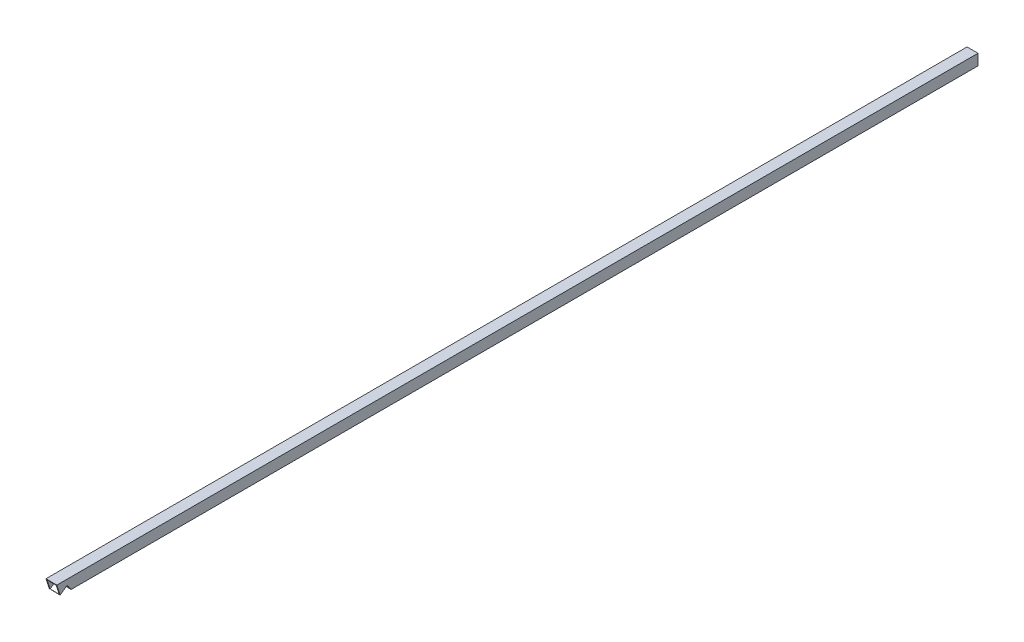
ISO-10303-21;
HEADER;
FILE_DESCRIPTION(('STEP AP214'),'2;1');
FILE_NAME('part.step','',(''),(''),'','','');
FILE_SCHEMA(('AUTOMOTIVE_DESIGN { 1 0 10303 214 1 1 1 1 }'));
ENDSEC;
DATA;
#1=APPLICATION_CONTEXT('core data for automotive mechanical design processes');
#2=APPLICATION_PROTOCOL_DEFINITION('international standard','automotive_design',2000,#1);
#3=PRODUCT_CONTEXT('',#1,'mechanical');
#4=PRODUCT('Part','Part','',(#3));
#5=PRODUCT_RELATED_PRODUCT_CATEGORY('part','',(#4));
#6=PRODUCT_DEFINITION_FORMATION('','',#4);
#7=PRODUCT_DEFINITION_CONTEXT('part definition',#1,'design');
#8=PRODUCT_DEFINITION('design','',#6,#7);
#9=PRODUCT_DEFINITION_SHAPE('','',#8);
#10=(LENGTH_UNIT() NAMED_UNIT(*) SI_UNIT(.MILLI.,.METRE.));
#11=(NAMED_UNIT(*) PLANE_ANGLE_UNIT() SI_UNIT($,.RADIAN.));
#12=(NAMED_UNIT(*) SI_UNIT($,.STERADIAN.) SOLID_ANGLE_UNIT());
#13=UNCERTAINTY_MEASURE_WITH_UNIT(LENGTH_MEASURE(1.E-05),#10,'distance_accuracy_value','');
#14=(GEOMETRIC_REPRESENTATION_CONTEXT(3) GLOBAL_UNCERTAINTY_ASSIGNED_CONTEXT((#13)) GLOBAL_UNIT_ASSIGNED_CONTEXT((#10,
#11,#12)) REPRESENTATION_CONTEXT('',''));
#15=CARTESIAN_POINT('',(0.,0.,0.));
#16=DIRECTION('',(0.,0.,1.));
#17=DIRECTION('',(1.,0.,0.));
#18=AXIS2_PLACEMENT_3D('',#15,#16,#17);
#19=CARTESIAN_POINT('',(-17.,-17.,-60.));
#20=DIRECTION('',(0.,1.,0.));
#21=DIRECTION('',(1.,0.,0.));
#22=AXIS2_PLACEMENT_3D('',#19,#20,#21);
#23=PLANE('',#22);
#24=DIRECTION('',(1.,0.,0.));
#25=VECTOR('',#24,1.);
#26=CARTESIAN_POINT('',(-8.5,-17.,3350.151413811));
#27=LINE('',#26,#25);
#28=CARTESIAN_POINT('',(-17.,-17.,3350.151413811));
#29=VERTEX_POINT('',#28);
#30=CARTESIAN_POINT('',(17.,-17.,3350.151413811));
#31=VERTEX_POINT('',#30);
#32=EDGE_CURVE('E44',#29,#31,#27,.T.);
#33=ORIENTED_EDGE('',*,*,#32,.F.);
#34=DIRECTION('',(0.,0.,1.));
#35=VECTOR('',#34,1.);
#36=CARTESIAN_POINT('',(-17.,-17.,-60.));
#37=LINE('',#36,#35);
#38=CARTESIAN_POINT('',(-17.,-17.,3350.660626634));
#39=VERTEX_POINT('',#38);
#40=EDGE_CURVE('E312',#29,#39,#37,.T.);
#41=ORIENTED_EDGE('',*,*,#40,.T.);
#42=DIRECTION('',(-0.99993959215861,0.,-0.0109914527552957));
#43=VECTOR('',#42,1.);
#44=CARTESIAN_POINT('',(-45.65715380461,-17.,3350.345623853));
#45=LINE('',#44,#43);
#46=CARTESIAN_POINT('',(17.,-17.,3351.034358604));
#47=VERTEX_POINT('',#46);
#48=EDGE_CURVE('E317',#47,#39,#45,.T.);
#49=ORIENTED_EDGE('',*,*,#48,.F.);
#50=DIRECTION('',(0.,0.,1.));
#51=VECTOR('',#50,1.);
#52=CARTESIAN_POINT('',(17.,-17.,-60.));
#53=LINE('',#52,#51);
#54=EDGE_CURVE('E290',#31,#47,#53,.T.);
#55=ORIENTED_EDGE('',*,*,#54,.F.);
#56=EDGE_LOOP('',(#33,#41,#49,#55));
#57=FACE_BOUND('',#56,.T.);
#58=ADVANCED_FACE('F16',(#57),#23,.T.);
#59=CARTESIAN_POINT('',(25.49490152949,-2.340582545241,3325.717145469));
#60=DIRECTION('',(-0.999800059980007,0.0114654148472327,-0.0163824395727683));
#61=DIRECTION('',(0.,-0.819285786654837,-0.573385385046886));
#62=AXIS2_PLACEMENT_3D('',#59,#60,#61);
#63=CYLINDRICAL_SURFACE('',#62,2.);
#64=DIRECTION('',(-0.999800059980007,0.0114654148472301,-0.0163824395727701));
#65=VECTOR('',#64,1.);
#66=CARTESIAN_POINT('',(25.534893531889,-1.194041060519,3324.078901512));
#67=LINE('',#66,#65);
#68=CARTESIAN_POINT('',(-17.,-0.706263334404,3323.381936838));
#69=VERTEX_POINT('',#68);
#70=CARTESIAN_POINT('',(-20.,-0.671860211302,3323.332779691));
#71=VERTEX_POINT('',#70);
#72=EDGE_CURVE('E168',#69,#71,#67,.T.);
#73=ORIENTED_EDGE('',*,*,#72,.F.);
#74=CARTESIAN_POINT('',(-17.,-1.853263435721,3325.020836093));
#75=DIRECTION('',(1.,0.,0.));
#76=DIRECTION('',(0.,0.573385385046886,-0.819285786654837));
#77=AXIS2_PLACEMENT_3D('',#74,#75,#76);
#78=ELLIPSE('',#77,2.000399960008,2.);
#79=CARTESIAN_POINT('',(-17.,-0.214691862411,3326.167606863));
#80=VERTEX_POINT('',#79);
#81=EDGE_CURVE('E204',#69,#80,#78,.T.);
#82=ORIENTED_EDGE('',*,*,#81,.T.);
#83=DIRECTION('',(-0.999800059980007,0.0114654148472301,-0.0163824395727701));
#84=VECTOR('',#83,1.);
#85=CARTESIAN_POINT('',(25.49490152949,-0.702010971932,3326.86391624));
#86=LINE('',#85,#84);
#87=CARTESIAN_POINT('',(-20.,-0.180288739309,3326.118449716));
#88=VERTEX_POINT('',#87);
#89=EDGE_CURVE('E10',#80,#88,#86,.T.);
#90=ORIENTED_EDGE('',*,*,#89,.T.);
#91=CARTESIAN_POINT('',(-20.,-1.818860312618,3324.971678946));
#92=DIRECTION('',(1.,0.,0.));
#93=DIRECTION('',(0.,0.573385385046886,-0.819285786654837));
#94=AXIS2_PLACEMENT_3D('',#91,#92,#93);
#95=ELLIPSE('',#94,2.000399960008,2.);
#96=EDGE_CURVE('E172',#71,#88,#95,.T.);
#97=ORIENTED_EDGE('',*,*,#96,.F.);
#98=EDGE_LOOP('',(#73,#82,#90,#97));
#99=FACE_BOUND('',#98,.T.);
#100=ADVANCED_FACE('F345',(#99),#63,.F.);
#101=CARTESIAN_POINT('',(25.49490152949,-2.340582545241,3325.717145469));
#102=DIRECTION('',(-0.999800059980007,0.0114654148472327,-0.0163824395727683));
#103=DIRECTION('',(0.,-0.819285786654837,-0.573385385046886));
#104=AXIS2_PLACEMENT_3D('',#101,#102,#103);
#105=CYLINDRICAL_SURFACE('',#104,2.);
#106=DIRECTION('',(-0.999800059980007,0.0114654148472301,-0.0163824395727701));
#107=VECTOR('',#106,1.);
#108=CARTESIAN_POINT('',(25.534893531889,-1.194041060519,3324.078901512));
#109=LINE('',#108,#107);
#110=CARTESIAN_POINT('',(20.,-1.130568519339,3323.98820832));
#111=VERTEX_POINT('',#110);
#112=CARTESIAN_POINT('',(17.,-1.096165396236,3323.939051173));
#113=VERTEX_POINT('',#112);
#114=EDGE_CURVE('E241',#111,#113,#109,.T.);
#115=ORIENTED_EDGE('',*,*,#114,.F.);
#116=CARTESIAN_POINT('',(20.,-2.277568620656,3325.627107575));
#117=DIRECTION('',(-1.,0.,0.));
#118=DIRECTION('',(0.,0.573385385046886,-0.819285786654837));
#119=AXIS2_PLACEMENT_3D('',#116,#117,#118);
#120=ELLIPSE('',#119,2.000399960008,2.);
#121=CARTESIAN_POINT('',(20.,-0.638997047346,3326.773878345));
#122=VERTEX_POINT('',#121);
#123=EDGE_CURVE('E240',#122,#111,#120,.T.);
#124=ORIENTED_EDGE('',*,*,#123,.F.);
#125=DIRECTION('',(-0.999800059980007,0.0114654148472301,-0.0163824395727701));
#126=VECTOR('',#125,1.);
#127=CARTESIAN_POINT('',(25.49490152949,-0.702010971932,3326.86391624));
#128=LINE('',#127,#126);
#129=CARTESIAN_POINT('',(17.,-0.604593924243,3326.724721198));
#130=VERTEX_POINT('',#129);
#131=EDGE_CURVE('E24',#122,#130,#128,.T.);
#132=ORIENTED_EDGE('',*,*,#131,.T.);
#133=CARTESIAN_POINT('',(17.,-2.243165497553,3325.577950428));
#134=DIRECTION('',(-1.,0.,0.));
#135=DIRECTION('',(0.,0.573385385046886,-0.819285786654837));
#136=AXIS2_PLACEMENT_3D('',#133,#134,#135);
#137=ELLIPSE('',#136,2.000399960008,2.);
#138=EDGE_CURVE('E283',#130,#113,#137,.T.);
#139=ORIENTED_EDGE('',*,*,#138,.T.);
#140=EDGE_LOOP('',(#115,#124,#132,#139));
#141=FACE_BOUND('',#140,.T.);
#142=ADVANCED_FACE('F334',(#141),#105,.F.);
#143=CARTESIAN_POINT('',(0.,-14.74714415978,3346.932404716));
#144=DIRECTION('',(0.,0.819285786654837,0.573385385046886));
#145=DIRECTION('',(1.,0.,0.));
#146=AXIS2_PLACEMENT_3D('',#143,#144,#145);
#147=PLANE('',#146);
#148=DIRECTION('',(0.,-0.573385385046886,0.819285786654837));
#149=VECTOR('',#148,1.);
#150=CARTESIAN_POINT('',(-17.,790.70297218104,2196.059275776));
#151=LINE('',#150,#149);
#152=EDGE_CURVE('E208',#80,#29,#151,.T.);
#153=ORIENTED_EDGE('',*,*,#152,.T.);
#154=ORIENTED_EDGE('',*,*,#32,.T.);
#155=DIRECTION('',(0.,0.573385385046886,-0.819285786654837));
#156=VECTOR('',#155,1.);
#157=CARTESIAN_POINT('',(17.,785.11386858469,2204.045306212));
#158=LINE('',#157,#156);
#159=EDGE_CURVE('E286',#31,#130,#158,.T.);
#160=ORIENTED_EDGE('',*,*,#159,.T.);
#161=ORIENTED_EDGE('',*,*,#131,.F.);
#162=DIRECTION('',(0.,0.573385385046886,-0.819285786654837));
#163=VECTOR('',#162,1.);
#164=CARTESIAN_POINT('',(20.,784.62071238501,2204.749955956));
#165=LINE('',#164,#163);
#166=CARTESIAN_POINT('',(20.,-17.52518622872,3350.90182989));
#167=VERTEX_POINT('',#166);
#168=EDGE_CURVE('E199',#167,#122,#165,.T.);
#169=ORIENTED_EDGE('',*,*,#168,.F.);
#170=DIRECTION('',(0.999939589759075,-0.00630246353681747,0.00900531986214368));
#171=VECTOR('',#170,1.);
#172=CARTESIAN_POINT('',(-15.16649180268,-17.30353730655,3350.585125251));
#173=LINE('',#172,#171);
#174=CARTESIAN_POINT('',(-20.,-17.27307245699,3350.541595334));
#175=VERTEX_POINT('',#174);
#176=EDGE_CURVE('E207',#175,#167,#173,.T.);
#177=ORIENTED_EDGE('',*,*,#176,.F.);
#178=DIRECTION('',(0.,-0.573385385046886,0.819285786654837));
#179=VECTOR('',#178,1.);
#180=CARTESIAN_POINT('',(-20.,791.19612838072,2195.354626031));
#181=LINE('',#180,#179);
#182=EDGE_CURVE('E249',#88,#175,#181,.T.);
#183=ORIENTED_EDGE('',*,*,#182,.F.);
#184=ORIENTED_EDGE('',*,*,#89,.F.);
#185=EDGE_LOOP('',(#153,#154,#160,#161,#169,#177,#183,#184));
#186=FACE_BOUND('',#185,.T.);
#187=ADVANCED_FACE('F323',(#186),#147,.F.);
#188=CARTESIAN_POINT('',(-33.55533764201,-962.0070097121,3052.672961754));
#189=DIRECTION('',(0.0104832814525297,0.300548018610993,-0.953709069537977));
#190=DIRECTION('',(-0.99993959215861,0.,-0.0109914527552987));
#191=AXIS2_PLACEMENT_3D('',#188,#189,#190);
#192=PLANE('',#191);
#193=DIRECTION('',(0.,0.953761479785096,0.300564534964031));
#194=VECTOR('',#193,1.);
#195=CARTESIAN_POINT('',(-17.,-962.9270649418,3052.564997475));
#196=LINE('',#195,#194);
#197=CARTESIAN_POINT('',(-17.,17.,3361.37524911));
#198=VERTEX_POINT('',#197);
#199=EDGE_CURVE('E309',#39,#198,#196,.T.);
#200=ORIENTED_EDGE('',*,*,#199,.T.);
#201=DIRECTION('',(0.99993959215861,0.,0.0109914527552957));
#202=VECTOR('',#201,1.);
#203=CARTESIAN_POINT('',(-28.77696976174,17.,3361.245795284));
#204=LINE('',#203,#202);
#205=CARTESIAN_POINT('',(17.,17.,3361.74898108));
#206=VERTEX_POINT('',#205);
#207=EDGE_CURVE('E302',#198,#206,#204,.T.);
#208=ORIENTED_EDGE('',*,*,#207,.T.);
#209=DIRECTION('',(0.,-0.953761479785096,-0.300564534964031));
#210=VECTOR('',#209,1.);
#211=CARTESIAN_POINT('',(17.,-978.4984378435,3048.031629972));
#212=LINE('',#211,#210);
#213=EDGE_CURVE('E294',#206,#47,#212,.T.);
#214=ORIENTED_EDGE('',*,*,#213,.T.);
#215=ORIENTED_EDGE('',*,*,#48,.T.);
#216=EDGE_LOOP('',(#200,#208,#214,#215));
#217=FACE_BOUND('',#216,.T.);
#218=DIRECTION('',(0.,0.953761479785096,0.300564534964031));
#219=VECTOR('',#218,1.);
#220=CARTESIAN_POINT('',(-20.,-961.553120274,3052.96500049));
#221=LINE('',#220,#219);
#222=CARTESIAN_POINT('',(-20.,20.,3362.287680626));
#223=VERTEX_POINT('',#222);
#224=EDGE_CURVE('E266',#175,#223,#221,.T.);
#225=ORIENTED_EDGE('',*,*,#224,.F.);
#226=ORIENTED_EDGE('',*,*,#176,.T.);
#227=DIRECTION('',(0.,-0.953761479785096,-0.300564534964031));
#228=VECTOR('',#227,1.);
#229=CARTESIAN_POINT('',(20.,-979.8723825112,3047.631626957));
#230=LINE('',#229,#228);
#231=CARTESIAN_POINT('',(20.,20.,3362.727365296));
#232=VERTEX_POINT('',#231);
#233=EDGE_CURVE('E195',#232,#167,#230,.T.);
#234=ORIENTED_EDGE('',*,*,#233,.F.);
#235=DIRECTION('',(0.99993959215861,0.,0.0109914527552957));
#236=VECTOR('',#235,1.);
#237=CARTESIAN_POINT('',(-27.28754175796,20.,3362.207575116));
#238=LINE('',#237,#236);
#239=EDGE_CURVE('E274',#223,#232,#238,.T.);
#240=ORIENTED_EDGE('',*,*,#239,.F.);
#241=EDGE_LOOP('',(#225,#226,#234,#240));
#242=FACE_BOUND('',#241,.T.);
#243=ADVANCED_FACE('F343',(#217,#242),#192,.F.);
#244=CARTESIAN_POINT('',(-17.,17.,-60.));
#245=DIRECTION('',(1.,0.,0.));
#246=DIRECTION('',(0.,1.,0.));
#247=AXIS2_PLACEMENT_3D('',#244,#245,#246);
#248=PLANE('',#247);
#249=DIRECTION('',(0.,-1.,0.));
#250=VECTOR('',#249,1.);
#251=CARTESIAN_POINT('',(-17.,8.5,0.));
#252=LINE('',#251,#250);
#253=CARTESIAN_POINT('',(-17.,17.,0.));
#254=VERTEX_POINT('',#253);
#255=CARTESIAN_POINT('',(-17.,-17.,0.));
#256=VERTEX_POINT('',#255);
#257=EDGE_CURVE('E226',#254,#256,#252,.T.);
#258=ORIENTED_EDGE('',*,*,#257,.F.);
#259=DIRECTION('',(0.,0.,1.));
#260=VECTOR('',#259,1.);
#261=CARTESIAN_POINT('',(-17.,17.,-60.));
#262=LINE('',#261,#260);
#263=EDGE_CURVE('E305',#254,#198,#262,.T.);
#264=ORIENTED_EDGE('',*,*,#263,.T.);
#265=ORIENTED_EDGE('',*,*,#199,.F.);
#266=ORIENTED_EDGE('',*,*,#40,.F.);
#267=ORIENTED_EDGE('',*,*,#152,.F.);
#268=ORIENTED_EDGE('',*,*,#81,.F.);
#269=DIRECTION('',(0.,-0.819285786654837,-0.573385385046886));
#270=VECTOR('',#269,1.);
#271=CARTESIAN_POINT('',(-17.,-1227.781417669,2464.601067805));
#272=LINE('',#271,#270);
#273=CARTESIAN_POINT('',(-17.,-17.,3311.978601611));
#274=VERTEX_POINT('',#273);
#275=EDGE_CURVE('E257',#69,#274,#272,.T.);
#276=ORIENTED_EDGE('',*,*,#275,.T.);
#277=DIRECTION('',(0.,0.,1.));
#278=VECTOR('',#277,1.);
#279=CARTESIAN_POINT('',(-17.,-17.,-60.));
#280=LINE('',#279,#278);
#281=EDGE_CURVE('E277',#256,#274,#280,.T.);
#282=ORIENTED_EDGE('',*,*,#281,.F.);
#283=EDGE_LOOP('',(#258,#264,#265,#266,#267,#268,#276,#282));
#284=FACE_BOUND('',#283,.T.);
#285=ADVANCED_FACE('F348',(#284),#248,.T.);
#286=CARTESIAN_POINT('',(17.,17.,-60.));
#287=DIRECTION('',(0.,-1.,0.));
#288=DIRECTION('',(0.,0.,-1.));
#289=AXIS2_PLACEMENT_3D('',#286,#287,#288);
#290=PLANE('',#289);
#291=DIRECTION('',(-1.,0.,0.));
#292=VECTOR('',#291,1.);
#293=CARTESIAN_POINT('',(8.5,17.,0.));
#294=LINE('',#293,#292);
#295=CARTESIAN_POINT('',(17.,17.,0.));
#296=VERTEX_POINT('',#295);
#297=EDGE_CURVE('E222',#296,#254,#294,.T.);
#298=ORIENTED_EDGE('',*,*,#297,.F.);
#299=DIRECTION('',(0.,0.,1.));
#300=VECTOR('',#299,1.);
#301=CARTESIAN_POINT('',(17.,17.,-60.));
#302=LINE('',#301,#300);
#303=EDGE_CURVE('E298',#296,#206,#302,.T.);
#304=ORIENTED_EDGE('',*,*,#303,.T.);
#305=ORIENTED_EDGE('',*,*,#207,.F.);
#306=ORIENTED_EDGE('',*,*,#263,.F.);
#307=EDGE_LOOP('',(#298,#304,#305,#306));
#308=FACE_BOUND('',#307,.T.);
#309=ADVANCED_FACE('F386',(#308),#290,.T.);
#310=CARTESIAN_POINT('',(17.,-17.,-60.));
#311=DIRECTION('',(-1.,0.,0.));
#312=DIRECTION('',(0.,0.,1.));
#313=AXIS2_PLACEMENT_3D('',#310,#311,#312);
#314=PLANE('',#313);
#315=DIRECTION('',(0.,1.,0.));
#316=VECTOR('',#315,1.);
#317=CARTESIAN_POINT('',(17.,-8.5,0.));
#318=LINE('',#317,#316);
#319=CARTESIAN_POINT('',(17.,-17.,0.));
#320=VERTEX_POINT('',#319);
#321=EDGE_CURVE('E211',#320,#296,#318,.T.);
#322=ORIENTED_EDGE('',*,*,#321,.F.);
#323=DIRECTION('',(0.,0.,1.));
#324=VECTOR('',#323,1.);
#325=CARTESIAN_POINT('',(17.,-17.,-60.));
#326=LINE('',#325,#324);
#327=CARTESIAN_POINT('',(17.,-17.,3312.808592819));
#328=VERTEX_POINT('',#327);
#329=EDGE_CURVE('E280',#320,#328,#326,.T.);
#330=ORIENTED_EDGE('',*,*,#329,.T.);
#331=DIRECTION('',(0.,0.819285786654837,0.573385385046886));
#332=VECTOR('',#331,1.);
#333=CARTESIAN_POINT('',(17.,-1239.582216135,2457.172151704));
#334=LINE('',#333,#332);
#335=EDGE_CURVE('E245',#328,#113,#334,.T.);
#336=ORIENTED_EDGE('',*,*,#335,.T.);
#337=ORIENTED_EDGE('',*,*,#138,.F.);
#338=ORIENTED_EDGE('',*,*,#159,.F.);
#339=ORIENTED_EDGE('',*,*,#54,.T.);
#340=ORIENTED_EDGE('',*,*,#213,.F.);
#341=ORIENTED_EDGE('',*,*,#303,.F.);
#342=EDGE_LOOP('',(#322,#330,#336,#337,#338,#339,#340,#341));
#343=FACE_BOUND('',#342,.T.);
#344=ADVANCED_FACE('F331',(#343),#314,.T.);
#345=CARTESIAN_POINT('',(-17.,-17.,-60.));
#346=DIRECTION('',(0.,1.,0.));
#347=DIRECTION('',(1.,0.,0.));
#348=AXIS2_PLACEMENT_3D('',#345,#346,#347);
#349=PLANE('',#348);
#350=DIRECTION('',(1.,0.,0.));
#351=VECTOR('',#350,1.);
#352=CARTESIAN_POINT('',(-8.5,-17.,0.));
#353=LINE('',#352,#351);
#354=EDGE_CURVE('E230',#256,#320,#353,.T.);
#355=ORIENTED_EDGE('',*,*,#354,.F.);
#356=ORIENTED_EDGE('',*,*,#281,.T.);
#357=DIRECTION('',(0.999702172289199,0.,0.0244042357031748));
#358=VECTOR('',#357,1.);
#359=CARTESIAN_POINT('',(-44.21468273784,-17.,3311.314250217));
#360=LINE('',#359,#358);
#361=EDGE_CURVE('E253',#274,#328,#360,.T.);
#362=ORIENTED_EDGE('',*,*,#361,.T.);
#363=ORIENTED_EDGE('',*,*,#329,.F.);
#364=EDGE_LOOP('',(#355,#356,#362,#363));
#365=FACE_BOUND('',#364,.T.);
#366=ADVANCED_FACE('F364',(#365),#349,.T.);
#367=CARTESIAN_POINT('',(20.,20.,-60.));
#368=DIRECTION('',(0.,-1.,0.));
#369=DIRECTION('',(0.,0.,-1.));
#370=AXIS2_PLACEMENT_3D('',#367,#368,#369);
#371=PLANE('',#370);
#372=DIRECTION('',(0.,0.,1.));
#373=VECTOR('',#372,1.);
#374=CARTESIAN_POINT('',(-20.,20.,-60.));
#375=LINE('',#374,#373);
#376=CARTESIAN_POINT('',(-20.,20.,0.));
#377=VERTEX_POINT('',#376);
#378=EDGE_CURVE('E270',#377,#223,#375,.T.);
#379=ORIENTED_EDGE('',*,*,#378,.T.);
#380=ORIENTED_EDGE('',*,*,#239,.T.);
#381=DIRECTION('',(0.,0.,1.));
#382=VECTOR('',#381,1.);
#383=CARTESIAN_POINT('',(20.,20.,-60.));
#384=LINE('',#383,#382);
#385=CARTESIAN_POINT('',(20.,20.,0.));
#386=VERTEX_POINT('',#385);
#387=EDGE_CURVE('E200',#386,#232,#384,.T.);
#388=ORIENTED_EDGE('',*,*,#387,.F.);
#389=DIRECTION('',(-1.,0.,0.));
#390=VECTOR('',#389,1.);
#391=CARTESIAN_POINT('',(10.,20.,0.));
#392=LINE('',#391,#390);
#393=EDGE_CURVE('E203',#386,#377,#392,.T.);
#394=ORIENTED_EDGE('',*,*,#393,.T.);
#395=EDGE_LOOP('',(#379,#380,#388,#394));
#396=FACE_BOUND('',#395,.T.);
#397=ADVANCED_FACE('F362',(#396),#371,.F.);
#398=CARTESIAN_POINT('',(-20.,20.,-60.));
#399=DIRECTION('',(1.,0.,0.));
#400=DIRECTION('',(0.,1.,0.));
#401=AXIS2_PLACEMENT_3D('',#398,#399,#400);
#402=PLANE('',#401);
#403=DIRECTION('',(0.,0.,1.));
#404=VECTOR('',#403,1.);
#405=CARTESIAN_POINT('',(-20.,-20.,-60.));
#406=LINE('',#405,#404);
#407=CARTESIAN_POINT('',(-20.,-20.,0.));
#408=VERTEX_POINT('',#407);
#409=CARTESIAN_POINT('',(-20.,-20.,3309.805786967));
#410=VERTEX_POINT('',#409);
#411=EDGE_CURVE('E175',#408,#410,#406,.T.);
#412=ORIENTED_EDGE('',*,*,#411,.T.);
#413=DIRECTION('',(0.,-0.819285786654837,-0.573385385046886));
#414=VECTOR('',#413,1.);
#415=CARTESIAN_POINT('',(-20.,-1226.740170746,2465.256560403));
#416=LINE('',#415,#414);
#417=EDGE_CURVE('E159',#71,#410,#416,.T.);
#418=ORIENTED_EDGE('',*,*,#417,.F.);
#419=ORIENTED_EDGE('',*,*,#96,.T.);
#420=ORIENTED_EDGE('',*,*,#182,.T.);
#421=ORIENTED_EDGE('',*,*,#224,.T.);
#422=ORIENTED_EDGE('',*,*,#378,.F.);
#423=DIRECTION('',(0.,-1.,0.));
#424=VECTOR('',#423,1.);
#425=CARTESIAN_POINT('',(-20.,10.,0.));
#426=LINE('',#425,#424);
#427=EDGE_CURVE('E178',#377,#408,#426,.T.);
#428=ORIENTED_EDGE('',*,*,#427,.T.);
#429=EDGE_LOOP('',(#412,#418,#419,#420,#421,#422,#428));
#430=FACE_BOUND('',#429,.T.);
#431=ADVANCED_FACE('F176',(#430),#402,.F.);
#432=CARTESIAN_POINT('',(25.534893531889,-877.8298327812,2710.556539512));
#433=DIRECTION('',(-0.0199960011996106,-0.573270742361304,0.819121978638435));
#434=DIRECTION('',(-0.999392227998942,0.0348593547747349,0.));
#435=AXIS2_PLACEMENT_3D('',#432,#433,#434);
#436=PLANE('',#435);
#437=DIRECTION('',(0.,0.819285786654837,0.573385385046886));
#438=VECTOR('',#437,1.);
#439=CARTESIAN_POINT('',(20.,-1240.623463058,2456.516659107));
#440=LINE('',#439,#438);
#441=CARTESIAN_POINT('',(20.,-20.,3310.782247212));
#442=VERTEX_POINT('',#441);
#443=EDGE_CURVE('E246',#442,#111,#440,.T.);
#444=ORIENTED_EDGE('',*,*,#443,.T.);
#445=ORIENTED_EDGE('',*,*,#114,.T.);
#446=ORIENTED_EDGE('',*,*,#335,.F.);
#447=ORIENTED_EDGE('',*,*,#361,.F.);
#448=ORIENTED_EDGE('',*,*,#275,.F.);
#449=ORIENTED_EDGE('',*,*,#72,.T.);
#450=ORIENTED_EDGE('',*,*,#417,.T.);
#451=DIRECTION('',(0.999702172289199,0.,0.0244042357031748));
#452=VECTOR('',#451,1.);
#453=CARTESIAN_POINT('',(-45.66256599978,-20.,3309.17932508));
#454=LINE('',#453,#452);
#455=EDGE_CURVE('E164',#410,#442,#454,.T.);
#456=ORIENTED_EDGE('',*,*,#455,.T.);
#457=EDGE_LOOP('',(#444,#445,#446,#447,#448,#449,#450,#456));
#458=FACE_BOUND('',#457,.T.);
#459=ADVANCED_FACE('F162',(#458),#436,.T.);
#460=CARTESIAN_POINT('',(20.,-20.,-60.));
#461=DIRECTION('',(-1.,0.,0.));
#462=DIRECTION('',(0.,0.,1.));
#463=AXIS2_PLACEMENT_3D('',#460,#461,#462);
#464=PLANE('',#463);
#465=ORIENTED_EDGE('',*,*,#387,.T.);
#466=ORIENTED_EDGE('',*,*,#233,.T.);
#467=ORIENTED_EDGE('',*,*,#168,.T.);
#468=ORIENTED_EDGE('',*,*,#123,.T.);
#469=ORIENTED_EDGE('',*,*,#443,.F.);
#470=DIRECTION('',(0.,0.,1.));
#471=VECTOR('',#470,1.);
#472=CARTESIAN_POINT('',(20.,-20.,-60.));
#473=LINE('',#472,#471);
#474=CARTESIAN_POINT('',(20.,-20.,0.));
#475=VERTEX_POINT('',#474);
#476=EDGE_CURVE('E187',#475,#442,#473,.T.);
#477=ORIENTED_EDGE('',*,*,#476,.F.);
#478=DIRECTION('',(0.,1.,0.));
#479=VECTOR('',#478,1.);
#480=CARTESIAN_POINT('',(20.,-10.,0.));
#481=LINE('',#480,#479);
#482=EDGE_CURVE('E212',#475,#386,#481,.T.);
#483=ORIENTED_EDGE('',*,*,#482,.T.);
#484=EDGE_LOOP('',(#465,#466,#467,#468,#469,#477,#483));
#485=FACE_BOUND('',#484,.T.);
#486=ADVANCED_FACE('F341',(#485),#464,.F.);
#487=CARTESIAN_POINT('',(0.,0.,0.));
#488=DIRECTION('',(0.,0.,1.));
#489=DIRECTION('',(1.,0.,0.));
#490=AXIS2_PLACEMENT_3D('',#487,#488,#489);
#491=PLANE('',#490);
#492=ORIENTED_EDGE('',*,*,#321,.T.);
#493=ORIENTED_EDGE('',*,*,#297,.T.);
#494=ORIENTED_EDGE('',*,*,#257,.T.);
#495=ORIENTED_EDGE('',*,*,#354,.T.);
#496=EDGE_LOOP('',(#492,#493,#494,#495));
#497=FACE_BOUND('',#496,.T.);
#498=ORIENTED_EDGE('',*,*,#393,.F.);
#499=ORIENTED_EDGE('',*,*,#482,.F.);
#500=DIRECTION('',(1.,0.,0.));
#501=VECTOR('',#500,1.);
#502=CARTESIAN_POINT('',(-10.,-20.,0.));
#503=LINE('',#502,#501);
#504=EDGE_CURVE('E183',#408,#475,#503,.T.);
#505=ORIENTED_EDGE('',*,*,#504,.F.);
#506=ORIENTED_EDGE('',*,*,#427,.F.);
#507=EDGE_LOOP('',(#498,#499,#505,#506));
#508=FACE_BOUND('',#507,.T.);
#509=ADVANCED_FACE('F360',(#497,#508),#491,.F.);
#510=CARTESIAN_POINT('',(-20.,-20.,-60.));
#511=DIRECTION('',(0.,1.,0.));
#512=DIRECTION('',(1.,0.,0.));
#513=AXIS2_PLACEMENT_3D('',#510,#511,#512);
#514=PLANE('',#513);
#515=ORIENTED_EDGE('',*,*,#476,.T.);
#516=ORIENTED_EDGE('',*,*,#455,.F.);
#517=ORIENTED_EDGE('',*,*,#411,.F.);
#518=ORIENTED_EDGE('',*,*,#504,.T.);
#519=EDGE_LOOP('',(#515,#516,#517,#518));
#520=FACE_BOUND('',#519,.T.);
#521=ADVANCED_FACE('F185',(#520),#514,.F.);
#522=CLOSED_SHELL('',(#58,#100,#142,#187,#243,#285,#309,#344,#366,#397,#431,#459,#486,#509,#521));
#523=MANIFOLD_SOLID_BREP('B1',#522);
#524=ADVANCED_BREP_SHAPE_REPRESENTATION('',(#18,#523),#14);
#525=SHAPE_DEFINITION_REPRESENTATION(#9,#524);
ENDSEC;
END-ISO-10303-21;
